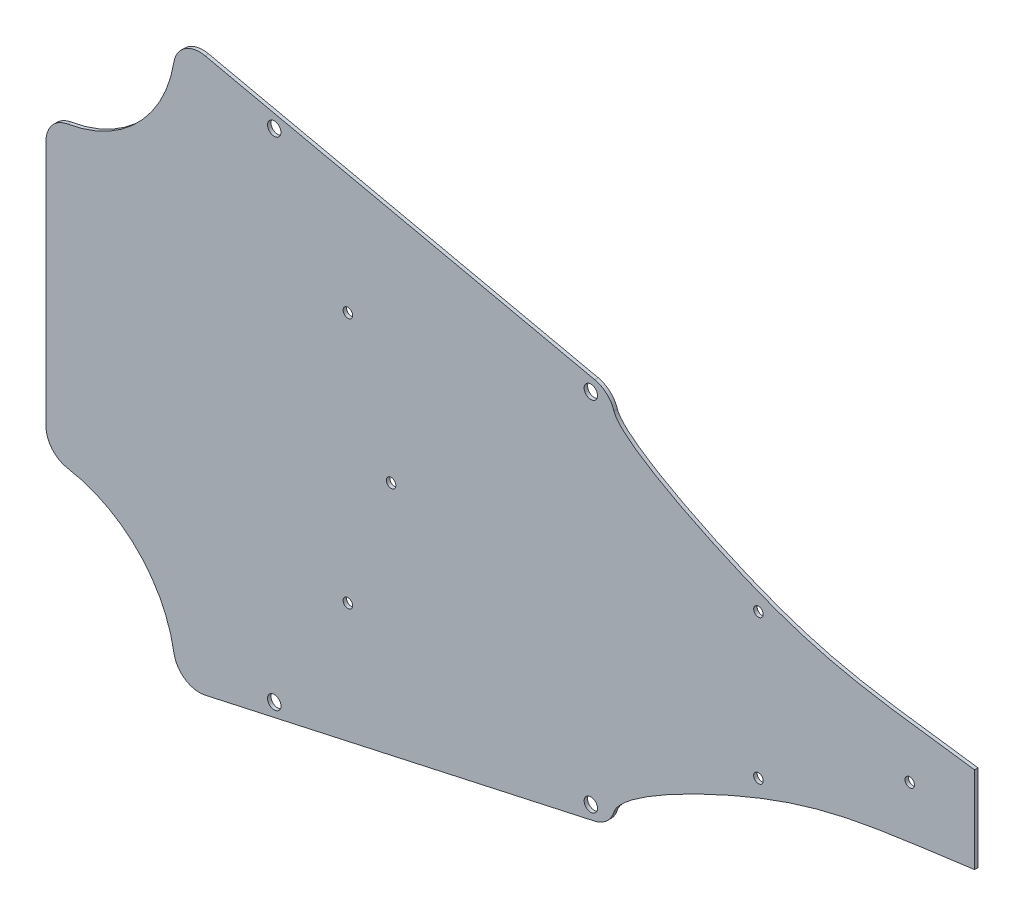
ISO-10303-21;
HEADER;
FILE_DESCRIPTION(('STEP AP214'),'2;1');
FILE_NAME('part.step','',(''),(''),'','','');
FILE_SCHEMA(('AUTOMOTIVE_DESIGN { 1 0 10303 214 1 1 1 1 }'));
ENDSEC;
DATA;
#1=APPLICATION_CONTEXT('core data for automotive mechanical design processes');
#2=APPLICATION_PROTOCOL_DEFINITION('international standard','automotive_design',2000,#1);
#3=PRODUCT_CONTEXT('',#1,'mechanical');
#4=PRODUCT('Part','Part','',(#3));
#5=PRODUCT_RELATED_PRODUCT_CATEGORY('part','',(#4));
#6=PRODUCT_DEFINITION_FORMATION('','',#4);
#7=PRODUCT_DEFINITION_CONTEXT('part definition',#1,'design');
#8=PRODUCT_DEFINITION('design','',#6,#7);
#9=PRODUCT_DEFINITION_SHAPE('','',#8);
#10=(LENGTH_UNIT() NAMED_UNIT(*) SI_UNIT(.MILLI.,.METRE.));
#11=(NAMED_UNIT(*) PLANE_ANGLE_UNIT() SI_UNIT($,.RADIAN.));
#12=(NAMED_UNIT(*) SI_UNIT($,.STERADIAN.) SOLID_ANGLE_UNIT());
#13=UNCERTAINTY_MEASURE_WITH_UNIT(LENGTH_MEASURE(1.E-05),#10,'distance_accuracy_value','');
#14=(GEOMETRIC_REPRESENTATION_CONTEXT(3) GLOBAL_UNCERTAINTY_ASSIGNED_CONTEXT((#13)) GLOBAL_UNIT_ASSIGNED_CONTEXT((#10,
#11,#12)) REPRESENTATION_CONTEXT('',''));
#15=CARTESIAN_POINT('',(0.,0.,0.));
#16=DIRECTION('',(0.,0.,1.));
#17=DIRECTION('',(1.,0.,0.));
#18=AXIS2_PLACEMENT_3D('',#15,#16,#17);
#19=CARTESIAN_POINT('',(60.6694487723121,58.200658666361,0.8));
#20=DIRECTION('',(0.,0.,1.));
#21=DIRECTION('',(1.,0.,0.));
#22=AXIS2_PLACEMENT_3D('',#19,#20,#21);
#23=PLANE('',#22);
#24=CARTESIAN_POINT('',(77.9645751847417,-57.4689156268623,0.8));
#25=DIRECTION('',(0.,0.,1.));
#26=DIRECTION('',(-1.,0.,0.));
#27=AXIS2_PLACEMENT_3D('',#24,#25,#26);
#28=CIRCLE('',#27,1.54999999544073);
#29=CARTESIAN_POINT('',(76.414575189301,-57.4689156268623,0.8));
#30=VERTEX_POINT('',#29);
#31=EDGE_CURVE('E460',#30,#30,#28,.T.);
#32=ORIENTED_EDGE('',*,*,#31,.F.);
#33=EDGE_LOOP('',(#32));
#34=FACE_BOUND('',#33,.T.);
#35=CARTESIAN_POINT('',(190.,-16.683070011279,0.8));
#36=DIRECTION('',(0.,0.,1.));
#37=DIRECTION('',(-1.,0.,0.));
#38=AXIS2_PLACEMENT_3D('',#35,#36,#37);
#39=CIRCLE('',#38,1.09999999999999);
#40=CARTESIAN_POINT('',(188.9,-16.683070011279,0.8));
#41=VERTEX_POINT('',#40);
#42=EDGE_CURVE('E472',#41,#41,#39,.T.);
#43=ORIENTED_EDGE('',*,*,#42,.F.);
#44=EDGE_LOOP('',(#43));
#45=FACE_BOUND('',#44,.T.);
#46=CARTESIAN_POINT('',(105.,0.,0.8));
#47=DIRECTION('',(0.,0.,1.));
#48=DIRECTION('',(1.,0.,0.));
#49=AXIS2_PLACEMENT_3D('',#46,#47,#48);
#50=CIRCLE('',#49,1.10000000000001);
#51=CARTESIAN_POINT('',(106.1,0.,0.8));
#52=VERTEX_POINT('',#51);
#53=EDGE_CURVE('E484',#52,#52,#50,.T.);
#54=ORIENTED_EDGE('',*,*,#53,.F.);
#55=EDGE_LOOP('',(#54));
#56=FACE_BOUND('',#55,.T.);
#57=CARTESIAN_POINT('',(190.,16.683070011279,0.8));
#58=DIRECTION('',(0.,0.,1.));
#59=DIRECTION('',(1.,0.,0.));
#60=AXIS2_PLACEMENT_3D('',#57,#58,#59);
#61=CIRCLE('',#60,1.09999999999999);
#62=CARTESIAN_POINT('',(191.1,16.683070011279,0.8));
#63=VERTEX_POINT('',#62);
#64=EDGE_CURVE('E496',#63,#63,#61,.T.);
#65=ORIENTED_EDGE('',*,*,#64,.F.);
#66=EDGE_LOOP('',(#65));
#67=FACE_BOUND('',#66,.T.);
#68=CARTESIAN_POINT('',(151.214241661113,41.3603352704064,0.8));
#69=DIRECTION('',(0.,0.,1.));
#70=DIRECTION('',(1.,0.,0.));
#71=AXIS2_PLACEMENT_3D('',#68,#69,#70);
#72=CIRCLE('',#71,1.54999999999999);
#73=CARTESIAN_POINT('',(152.764241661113,41.3603352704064,0.8));
#74=VERTEX_POINT('',#73);
#75=EDGE_CURVE('E146',#74,#74,#72,.T.);
#76=ORIENTED_EDGE('',*,*,#75,.F.);
#77=EDGE_LOOP('',(#76));
#78=FACE_BOUND('',#77,.T.);
#79=CARTESIAN_POINT('',(60.6694487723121,58.200658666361,0.8));
#80=DIRECTION('',(0.,0.,1.));
#81=DIRECTION('',(1.,0.,0.));
#82=AXIS2_PLACEMENT_3D('',#79,#80,#81);
#83=CIRCLE('',#82,6.);
#84=CARTESIAN_POINT('',(61.9581352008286,64.0606319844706,0.8));
#85=VERTEX_POINT('',#84);
#86=CARTESIAN_POINT('',(54.7496279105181,59.1782684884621,0.8));
#87=VERTEX_POINT('',#86);
#88=EDGE_CURVE('E186',#85,#87,#83,.T.);
#89=ORIENTED_EDGE('',*,*,#88,.T.);
#90=CARTESIAN_POINT('',(25.1505236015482,64.0663175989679,0.8));
#91=DIRECTION('',(0.,0.,-1.));
#92=DIRECTION('',(1.,0.,0.));
#93=AXIS2_PLACEMENT_3D('',#90,#91,#92);
#94=CIRCLE('',#93,30.);
#95=CARTESIAN_POINT('',(30.1505236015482,34.4859186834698,0.8));
#96=VERTEX_POINT('',#95);
#97=EDGE_CURVE('E141',#87,#96,#94,.T.);
#98=ORIENTED_EDGE('',*,*,#97,.T.);
#99=CARTESIAN_POINT('',(31.1505236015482,28.5698389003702,0.8));
#100=DIRECTION('',(0.,0.,1.));
#101=DIRECTION('',(1.,0.,0.));
#102=AXIS2_PLACEMENT_3D('',#99,#100,#101);
#103=CIRCLE('',#102,6.);
#104=CARTESIAN_POINT('',(25.1505236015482,28.5698389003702,0.8));
#105=VERTEX_POINT('',#104);
#106=EDGE_CURVE('E189',#96,#105,#103,.T.);
#107=ORIENTED_EDGE('',*,*,#106,.T.);
#108=DIRECTION('',(0.,-1.,0.));
#109=VECTOR('',#108,1.);
#110=CARTESIAN_POINT('',(25.1505236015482,28.5698389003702,0.8));
#111=LINE('',#110,#109);
#112=CARTESIAN_POINT('',(25.1505236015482,-28.5698389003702,0.8));
#113=VERTEX_POINT('',#112);
#114=EDGE_CURVE('E191',#105,#113,#111,.T.);
#115=ORIENTED_EDGE('',*,*,#114,.T.);
#116=CARTESIAN_POINT('',(31.1505236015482,-28.5698389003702,0.8));
#117=DIRECTION('',(0.,0.,1.));
#118=DIRECTION('',(-1.,0.,0.));
#119=AXIS2_PLACEMENT_3D('',#116,#117,#118);
#120=CIRCLE('',#119,6.);
#121=CARTESIAN_POINT('',(30.1505236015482,-34.4859186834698,0.8));
#122=VERTEX_POINT('',#121);
#123=EDGE_CURVE('E193',#113,#122,#120,.T.);
#124=ORIENTED_EDGE('',*,*,#123,.T.);
#125=CARTESIAN_POINT('',(25.1505236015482,-64.0663175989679,0.8));
#126=DIRECTION('',(0.,0.,-1.));
#127=DIRECTION('',(-1.,0.,0.));
#128=AXIS2_PLACEMENT_3D('',#125,#126,#127);
#129=CIRCLE('',#128,30.);
#130=CARTESIAN_POINT('',(54.7496279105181,-59.1782684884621,0.8));
#131=VERTEX_POINT('',#130);
#132=EDGE_CURVE('E195',#122,#131,#129,.T.);
#133=ORIENTED_EDGE('',*,*,#132,.T.);
#134=CARTESIAN_POINT('',(60.6694487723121,-58.200658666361,0.8));
#135=DIRECTION('',(0.,0.,1.));
#136=DIRECTION('',(-1.,0.,0.));
#137=AXIS2_PLACEMENT_3D('',#134,#135,#136);
#138=CIRCLE('',#137,6.);
#139=CARTESIAN_POINT('',(61.9581352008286,-64.0606319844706,0.8));
#140=VERTEX_POINT('',#139);
#141=EDGE_CURVE('E197',#131,#140,#138,.T.);
#142=ORIENTED_EDGE('',*,*,#141,.T.);
#143=DIRECTION('',(0.976662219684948,0.214781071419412,0.));
#144=VECTOR('',#143,1.);
#145=CARTESIAN_POINT('',(61.9581352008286,-64.0606319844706,0.8));
#146=LINE('',#145,#144);
#147=CARTESIAN_POINT('',(152.13131433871,-44.2303450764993,0.8));
#148=VERTEX_POINT('',#147);
#149=EDGE_CURVE('E199',#140,#148,#146,.T.);
#150=ORIENTED_EDGE('',*,*,#149,.T.);
#151=CARTESIAN_POINT('',(150.842627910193,-38.3703717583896,0.8));
#152=DIRECTION('',(0.,0.,1.));
#153=DIRECTION('',(1.,0.,0.));
#154=AXIS2_PLACEMENT_3D('',#151,#152,#153);
#155=CIRCLE('',#154,6.00000000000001);
#156=CARTESIAN_POINT('',(156.555979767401,-40.2027501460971,0.8));
#157=VERTEX_POINT('',#156);
#158=EDGE_CURVE('E201',#148,#157,#155,.T.);
#159=ORIENTED_EDGE('',*,*,#158,.T.);
#160=CARTESIAN_POINT('',(156.555979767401,-40.2027501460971,0.8));
#161=CARTESIAN_POINT('',(158.014867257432,-35.6539421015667,0.8));
#162=CARTESIAN_POINT('',(198.784165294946,-14.481909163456,0.8));
#163=CARTESIAN_POINT('',(216.274031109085,-13.2295178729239,0.8));
#164=CARTESIAN_POINT('',(240.,-10.,0.8));
#165=B_SPLINE_CURVE_WITH_KNOTS('',3,(#160,#161,#162,#163,#164),.UNSPECIFIED.,.F.,.F.,(4,1,4),
(0.,0.347185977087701,0.920874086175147),.UNSPECIFIED.);
#166=CARTESIAN_POINT('',(240.,-10.,0.8));
#167=VERTEX_POINT('',#166);
#168=EDGE_CURVE('E203',#157,#167,#165,.T.);
#169=ORIENTED_EDGE('',*,*,#168,.T.);
#170=DIRECTION('',(0.,1.,0.));
#171=VECTOR('',#170,1.);
#172=CARTESIAN_POINT('',(240.,10.,0.8));
#173=LINE('',#172,#171);
#174=CARTESIAN_POINT('',(240.,10.,0.8));
#175=VERTEX_POINT('',#174);
#176=EDGE_CURVE('E208',#167,#175,#173,.T.);
#177=ORIENTED_EDGE('',*,*,#176,.T.);
#178=CARTESIAN_POINT('',(240.,10.,0.8));
#179=CARTESIAN_POINT('',(216.274031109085,13.2295178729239,0.8));
#180=CARTESIAN_POINT('',(198.784165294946,14.481909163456,0.8));
#181=CARTESIAN_POINT('',(158.014867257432,35.6539421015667,0.8));
#182=CARTESIAN_POINT('',(156.555979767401,40.2027501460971,0.8));
#183=B_SPLINE_CURVE_WITH_KNOTS('',3,(#178,#179,#180,#181,#182),.UNSPECIFIED.,.F.,.F.,(4,1,4),
(0.,0.573688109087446,0.920874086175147),.UNSPECIFIED.);
#184=CARTESIAN_POINT('',(156.555979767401,40.2027501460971,0.8));
#185=VERTEX_POINT('',#184);
#186=EDGE_CURVE('E275',#175,#185,#183,.T.);
#187=ORIENTED_EDGE('',*,*,#186,.T.);
#188=CARTESIAN_POINT('',(150.842627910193,38.3703717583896,0.8));
#189=DIRECTION('',(0.,0.,1.));
#190=DIRECTION('',(-1.,0.,0.));
#191=AXIS2_PLACEMENT_3D('',#188,#189,#190);
#192=CIRCLE('',#191,6.00000000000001);
#193=CARTESIAN_POINT('',(152.13131433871,44.2303450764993,0.8));
#194=VERTEX_POINT('',#193);
#195=EDGE_CURVE('E46',#185,#194,#192,.T.);
#196=ORIENTED_EDGE('',*,*,#195,.T.);
#197=DIRECTION('',(-0.976662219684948,0.214781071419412,0.));
#198=VECTOR('',#197,1.);
#199=CARTESIAN_POINT('',(61.9581352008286,64.0606319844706,0.8));
#200=LINE('',#199,#198);
#201=EDGE_CURVE('E41',#194,#85,#200,.T.);
#202=ORIENTED_EDGE('',*,*,#201,.T.);
#203=EDGE_LOOP('',(#89,#98,#107,#115,#124,#133,#142,#150,#159,#169,#177,#187,#196,#202));
#204=FACE_BOUND('',#203,.T.);
#205=CARTESIAN_POINT('',(151.214241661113,-41.3603352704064,0.8));
#206=DIRECTION('',(0.,0.,1.));
#207=DIRECTION('',(-1.,0.,0.));
#208=AXIS2_PLACEMENT_3D('',#205,#206,#207);
#209=CIRCLE('',#208,1.54999999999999);
#210=CARTESIAN_POINT('',(149.664241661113,-41.3603352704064,0.8));
#211=VERTEX_POINT('',#210);
#212=EDGE_CURVE('E502',#211,#211,#209,.T.);
#213=ORIENTED_EDGE('',*,*,#212,.F.);
#214=EDGE_LOOP('',(#213));
#215=FACE_BOUND('',#214,.T.);
#216=CARTESIAN_POINT('',(225.,0.,0.8));
#217=DIRECTION('',(0.,0.,1.));
#218=DIRECTION('',(1.,0.,0.));
#219=AXIS2_PLACEMENT_3D('',#216,#217,#218);
#220=CIRCLE('',#219,1.09999999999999);
#221=CARTESIAN_POINT('',(226.1,0.,0.8));
#222=VERTEX_POINT('',#221);
#223=EDGE_CURVE('E490',#222,#222,#220,.T.);
#224=ORIENTED_EDGE('',*,*,#223,.F.);
#225=EDGE_LOOP('',(#224));
#226=FACE_BOUND('',#225,.T.);
#227=CARTESIAN_POINT('',(95.,29.078947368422,0.8));
#228=DIRECTION('',(0.,0.,1.));
#229=DIRECTION('',(1.,0.,0.));
#230=AXIS2_PLACEMENT_3D('',#227,#228,#229);
#231=CIRCLE('',#230,1.09999999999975);
#232=CARTESIAN_POINT('',(96.0999999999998,29.078947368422,0.8));
#233=VERTEX_POINT('',#232);
#234=EDGE_CURVE('E478',#233,#233,#231,.T.);
#235=ORIENTED_EDGE('',*,*,#234,.F.);
#236=EDGE_LOOP('',(#235));
#237=FACE_BOUND('',#236,.T.);
#238=CARTESIAN_POINT('',(95.,-29.0789473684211,0.8));
#239=DIRECTION('',(0.,0.,1.));
#240=DIRECTION('',(-1.,0.,0.));
#241=AXIS2_PLACEMENT_3D('',#238,#239,#240);
#242=CIRCLE('',#241,1.10000000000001);
#243=CARTESIAN_POINT('',(93.9,-29.0789473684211,0.8));
#244=VERTEX_POINT('',#243);
#245=EDGE_CURVE('E466',#244,#244,#242,.T.);
#246=ORIENTED_EDGE('',*,*,#245,.F.);
#247=EDGE_LOOP('',(#246));
#248=FACE_BOUND('',#247,.T.);
#249=CARTESIAN_POINT('',(77.9645751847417,57.4689156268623,0.8));
#250=DIRECTION('',(0.,0.,1.));
#251=DIRECTION('',(1.,0.,0.));
#252=AXIS2_PLACEMENT_3D('',#249,#250,#251);
#253=CIRCLE('',#252,1.54999999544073);
#254=CARTESIAN_POINT('',(79.5145751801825,57.4689156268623,0.8));
#255=VERTEX_POINT('',#254);
#256=EDGE_CURVE('E449',#255,#255,#253,.T.);
#257=ORIENTED_EDGE('',*,*,#256,.F.);
#258=EDGE_LOOP('',(#257));
#259=FACE_BOUND('',#258,.T.);
#260=ADVANCED_FACE('F26',(#34,#45,#56,#67,#78,#204,#215,#226,#237,#248,#259),#23,.T.);
#261=CARTESIAN_POINT('',(60.6694487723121,58.200658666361,0.));
#262=DIRECTION('',(0.,0.,1.));
#263=DIRECTION('',(1.,0.,0.));
#264=AXIS2_PLACEMENT_3D('',#261,#262,#263);
#265=PLANE('',#264);
#266=CARTESIAN_POINT('',(77.9645751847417,-57.4689156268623,0.));
#267=DIRECTION('',(0.,0.,1.));
#268=DIRECTION('',(-1.,0.,0.));
#269=AXIS2_PLACEMENT_3D('',#266,#267,#268);
#270=CIRCLE('',#269,1.54999999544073);
#271=CARTESIAN_POINT('',(76.414575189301,-57.4689156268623,0.));
#272=VERTEX_POINT('',#271);
#273=EDGE_CURVE('E455',#272,#272,#270,.T.);
#274=ORIENTED_EDGE('',*,*,#273,.T.);
#275=EDGE_LOOP('',(#274));
#276=FACE_BOUND('',#275,.T.);
#277=CARTESIAN_POINT('',(190.,-16.683070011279,0.));
#278=DIRECTION('',(0.,0.,1.));
#279=DIRECTION('',(-1.,0.,0.));
#280=AXIS2_PLACEMENT_3D('',#277,#278,#279);
#281=CIRCLE('',#280,1.09999999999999);
#282=CARTESIAN_POINT('',(188.9,-16.683070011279,0.));
#283=VERTEX_POINT('',#282);
#284=EDGE_CURVE('E469',#283,#283,#281,.T.);
#285=ORIENTED_EDGE('',*,*,#284,.T.);
#286=EDGE_LOOP('',(#285));
#287=FACE_BOUND('',#286,.T.);
#288=CARTESIAN_POINT('',(105.,0.,0.));
#289=DIRECTION('',(0.,0.,1.));
#290=DIRECTION('',(1.,0.,0.));
#291=AXIS2_PLACEMENT_3D('',#288,#289,#290);
#292=CIRCLE('',#291,1.10000000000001);
#293=CARTESIAN_POINT('',(106.1,0.,0.));
#294=VERTEX_POINT('',#293);
#295=EDGE_CURVE('E481',#294,#294,#292,.T.);
#296=ORIENTED_EDGE('',*,*,#295,.T.);
#297=EDGE_LOOP('',(#296));
#298=FACE_BOUND('',#297,.T.);
#299=CARTESIAN_POINT('',(190.,16.683070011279,0.));
#300=DIRECTION('',(0.,0.,1.));
#301=DIRECTION('',(1.,0.,0.));
#302=AXIS2_PLACEMENT_3D('',#299,#300,#301);
#303=CIRCLE('',#302,1.09999999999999);
#304=CARTESIAN_POINT('',(191.1,16.683070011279,0.));
#305=VERTEX_POINT('',#304);
#306=EDGE_CURVE('E493',#305,#305,#303,.T.);
#307=ORIENTED_EDGE('',*,*,#306,.T.);
#308=EDGE_LOOP('',(#307));
#309=FACE_BOUND('',#308,.T.);
#310=CARTESIAN_POINT('',(151.214241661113,41.3603352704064,0.));
#311=DIRECTION('',(0.,0.,1.));
#312=DIRECTION('',(1.,0.,0.));
#313=AXIS2_PLACEMENT_3D('',#310,#311,#312);
#314=CIRCLE('',#313,1.54999999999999);
#315=CARTESIAN_POINT('',(152.764241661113,41.3603352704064,0.));
#316=VERTEX_POINT('',#315);
#317=EDGE_CURVE('E149',#316,#316,#314,.T.);
#318=ORIENTED_EDGE('',*,*,#317,.T.);
#319=EDGE_LOOP('',(#318));
#320=FACE_BOUND('',#319,.T.);
#321=CARTESIAN_POINT('',(60.6694487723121,58.200658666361,0.));
#322=DIRECTION('',(0.,0.,1.));
#323=DIRECTION('',(1.,0.,0.));
#324=AXIS2_PLACEMENT_3D('',#321,#322,#323);
#325=CIRCLE('',#324,6.);
#326=CARTESIAN_POINT('',(61.9581352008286,64.0606319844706,0.));
#327=VERTEX_POINT('',#326);
#328=CARTESIAN_POINT('',(54.7496279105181,59.1782684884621,0.));
#329=VERTEX_POINT('',#328);
#330=EDGE_CURVE('E132',#327,#329,#325,.T.);
#331=ORIENTED_EDGE('',*,*,#330,.F.);
#332=DIRECTION('',(-0.976662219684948,0.214781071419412,0.));
#333=VECTOR('',#332,1.);
#334=CARTESIAN_POINT('',(61.9581352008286,64.0606319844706,0.));
#335=LINE('',#334,#333);
#336=CARTESIAN_POINT('',(152.13131433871,44.2303450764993,0.));
#337=VERTEX_POINT('',#336);
#338=EDGE_CURVE('E184',#337,#327,#335,.T.);
#339=ORIENTED_EDGE('',*,*,#338,.F.);
#340=CARTESIAN_POINT('',(150.842627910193,38.3703717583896,0.));
#341=DIRECTION('',(0.,0.,1.));
#342=DIRECTION('',(-1.,0.,0.));
#343=AXIS2_PLACEMENT_3D('',#340,#341,#342);
#344=CIRCLE('',#343,6.00000000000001);
#345=CARTESIAN_POINT('',(156.555979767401,40.2027501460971,0.));
#346=VERTEX_POINT('',#345);
#347=EDGE_CURVE('E179',#346,#337,#344,.T.);
#348=ORIENTED_EDGE('',*,*,#347,.F.);
#349=CARTESIAN_POINT('',(240.,10.,0.));
#350=CARTESIAN_POINT('',(216.274031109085,13.2295178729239,0.));
#351=CARTESIAN_POINT('',(198.784165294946,14.481909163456,0.));
#352=CARTESIAN_POINT('',(158.014867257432,35.6539421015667,0.));
#353=CARTESIAN_POINT('',(156.555979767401,40.2027501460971,0.));
#354=B_SPLINE_CURVE_WITH_KNOTS('',3,(#349,#350,#351,#352,#353),.UNSPECIFIED.,.F.,.F.,(4,1,4),
(0.,0.573688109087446,0.920874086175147),.UNSPECIFIED.);
#355=CARTESIAN_POINT('',(240.,10.,0.));
#356=VERTEX_POINT('',#355);
#357=EDGE_CURVE('E175',#356,#346,#354,.T.);
#358=ORIENTED_EDGE('',*,*,#357,.F.);
#359=DIRECTION('',(0.,1.,0.));
#360=VECTOR('',#359,1.);
#361=CARTESIAN_POINT('',(240.,10.,0.));
#362=LINE('',#361,#360);
#363=CARTESIAN_POINT('',(240.,-10.,0.));
#364=VERTEX_POINT('',#363);
#365=EDGE_CURVE('E170',#364,#356,#362,.T.);
#366=ORIENTED_EDGE('',*,*,#365,.F.);
#367=CARTESIAN_POINT('',(156.555979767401,-40.2027501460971,0.));
#368=CARTESIAN_POINT('',(158.014867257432,-35.6539421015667,0.));
#369=CARTESIAN_POINT('',(198.784165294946,-14.481909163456,0.));
#370=CARTESIAN_POINT('',(216.274031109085,-13.2295178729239,0.));
#371=CARTESIAN_POINT('',(240.,-10.,0.));
#372=B_SPLINE_CURVE_WITH_KNOTS('',3,(#367,#368,#369,#370,#371),.UNSPECIFIED.,.F.,.F.,(4,1,4),
(0.,0.347185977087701,0.920874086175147),.UNSPECIFIED.);
#373=CARTESIAN_POINT('',(156.555979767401,-40.2027501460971,0.));
#374=VERTEX_POINT('',#373);
#375=EDGE_CURVE('E166',#374,#364,#372,.T.);
#376=ORIENTED_EDGE('',*,*,#375,.F.);
#377=CARTESIAN_POINT('',(150.842627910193,-38.3703717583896,0.));
#378=DIRECTION('',(0.,0.,1.));
#379=DIRECTION('',(1.,0.,0.));
#380=AXIS2_PLACEMENT_3D('',#377,#378,#379);
#381=CIRCLE('',#380,6.00000000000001);
#382=CARTESIAN_POINT('',(152.13131433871,-44.2303450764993,0.));
#383=VERTEX_POINT('',#382);
#384=EDGE_CURVE('E164',#383,#374,#381,.T.);
#385=ORIENTED_EDGE('',*,*,#384,.F.);
#386=DIRECTION('',(0.976662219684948,0.214781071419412,0.));
#387=VECTOR('',#386,1.);
#388=CARTESIAN_POINT('',(61.9581352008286,-64.0606319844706,0.));
#389=LINE('',#388,#387);
#390=CARTESIAN_POINT('',(61.9581352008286,-64.0606319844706,0.));
#391=VERTEX_POINT('',#390);
#392=EDGE_CURVE('E162',#391,#383,#389,.T.);
#393=ORIENTED_EDGE('',*,*,#392,.F.);
#394=CARTESIAN_POINT('',(60.6694487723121,-58.200658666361,0.));
#395=DIRECTION('',(0.,0.,1.));
#396=DIRECTION('',(-1.,0.,0.));
#397=AXIS2_PLACEMENT_3D('',#394,#395,#396);
#398=CIRCLE('',#397,6.);
#399=CARTESIAN_POINT('',(54.7496279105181,-59.1782684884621,0.));
#400=VERTEX_POINT('',#399);
#401=EDGE_CURVE('E160',#400,#391,#398,.T.);
#402=ORIENTED_EDGE('',*,*,#401,.F.);
#403=CARTESIAN_POINT('',(25.1505236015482,-64.0663175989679,0.));
#404=DIRECTION('',(0.,0.,-1.));
#405=DIRECTION('',(-1.,0.,0.));
#406=AXIS2_PLACEMENT_3D('',#403,#404,#405);
#407=CIRCLE('',#406,30.);
#408=CARTESIAN_POINT('',(30.1505236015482,-34.4859186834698,0.));
#409=VERTEX_POINT('',#408);
#410=EDGE_CURVE('E158',#409,#400,#407,.T.);
#411=ORIENTED_EDGE('',*,*,#410,.F.);
#412=CARTESIAN_POINT('',(31.1505236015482,-28.5698389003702,0.));
#413=DIRECTION('',(0.,0.,1.));
#414=DIRECTION('',(-1.,0.,0.));
#415=AXIS2_PLACEMENT_3D('',#412,#413,#414);
#416=CIRCLE('',#415,6.);
#417=CARTESIAN_POINT('',(25.1505236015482,-28.5698389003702,0.));
#418=VERTEX_POINT('',#417);
#419=EDGE_CURVE('E156',#418,#409,#416,.T.);
#420=ORIENTED_EDGE('',*,*,#419,.F.);
#421=DIRECTION('',(0.,-1.,0.));
#422=VECTOR('',#421,1.);
#423=CARTESIAN_POINT('',(25.1505236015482,28.5698389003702,0.));
#424=LINE('',#423,#422);
#425=CARTESIAN_POINT('',(25.1505236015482,28.5698389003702,0.));
#426=VERTEX_POINT('',#425);
#427=EDGE_CURVE('E154',#426,#418,#424,.T.);
#428=ORIENTED_EDGE('',*,*,#427,.F.);
#429=CARTESIAN_POINT('',(31.1505236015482,28.5698389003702,0.));
#430=DIRECTION('',(0.,0.,1.));
#431=DIRECTION('',(1.,0.,0.));
#432=AXIS2_PLACEMENT_3D('',#429,#430,#431);
#433=CIRCLE('',#432,6.);
#434=CARTESIAN_POINT('',(30.1505236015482,34.4859186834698,0.));
#435=VERTEX_POINT('',#434);
#436=EDGE_CURVE('E134',#435,#426,#433,.T.);
#437=ORIENTED_EDGE('',*,*,#436,.F.);
#438=CARTESIAN_POINT('',(25.1505236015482,64.0663175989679,0.));
#439=DIRECTION('',(0.,0.,-1.));
#440=DIRECTION('',(1.,0.,0.));
#441=AXIS2_PLACEMENT_3D('',#438,#439,#440);
#442=CIRCLE('',#441,30.);
#443=EDGE_CURVE('E127',#329,#435,#442,.T.);
#444=ORIENTED_EDGE('',*,*,#443,.F.);
#445=EDGE_LOOP('',(#331,#339,#348,#358,#366,#376,#385,#393,#402,#411,#420,#428,#437,#444));
#446=FACE_BOUND('',#445,.T.);
#447=CARTESIAN_POINT('',(151.214241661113,-41.3603352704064,0.));
#448=DIRECTION('',(0.,0.,1.));
#449=DIRECTION('',(-1.,0.,0.));
#450=AXIS2_PLACEMENT_3D('',#447,#448,#449);
#451=CIRCLE('',#450,1.54999999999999);
#452=CARTESIAN_POINT('',(149.664241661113,-41.3603352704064,0.));
#453=VERTEX_POINT('',#452);
#454=EDGE_CURVE('E499',#453,#453,#451,.T.);
#455=ORIENTED_EDGE('',*,*,#454,.T.);
#456=EDGE_LOOP('',(#455));
#457=FACE_BOUND('',#456,.T.);
#458=CARTESIAN_POINT('',(225.,0.,0.));
#459=DIRECTION('',(0.,0.,1.));
#460=DIRECTION('',(1.,0.,0.));
#461=AXIS2_PLACEMENT_3D('',#458,#459,#460);
#462=CIRCLE('',#461,1.09999999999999);
#463=CARTESIAN_POINT('',(226.1,0.,0.));
#464=VERTEX_POINT('',#463);
#465=EDGE_CURVE('E487',#464,#464,#462,.T.);
#466=ORIENTED_EDGE('',*,*,#465,.T.);
#467=EDGE_LOOP('',(#466));
#468=FACE_BOUND('',#467,.T.);
#469=CARTESIAN_POINT('',(95.,29.078947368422,0.));
#470=DIRECTION('',(0.,0.,1.));
#471=DIRECTION('',(1.,0.,0.));
#472=AXIS2_PLACEMENT_3D('',#469,#470,#471);
#473=CIRCLE('',#472,1.09999999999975);
#474=CARTESIAN_POINT('',(96.0999999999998,29.078947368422,0.));
#475=VERTEX_POINT('',#474);
#476=EDGE_CURVE('E475',#475,#475,#473,.T.);
#477=ORIENTED_EDGE('',*,*,#476,.T.);
#478=EDGE_LOOP('',(#477));
#479=FACE_BOUND('',#478,.T.);
#480=CARTESIAN_POINT('',(95.,-29.0789473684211,0.));
#481=DIRECTION('',(0.,0.,1.));
#482=DIRECTION('',(-1.,0.,0.));
#483=AXIS2_PLACEMENT_3D('',#480,#481,#482);
#484=CIRCLE('',#483,1.10000000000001);
#485=CARTESIAN_POINT('',(93.9,-29.0789473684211,0.));
#486=VERTEX_POINT('',#485);
#487=EDGE_CURVE('E463',#486,#486,#484,.T.);
#488=ORIENTED_EDGE('',*,*,#487,.T.);
#489=EDGE_LOOP('',(#488));
#490=FACE_BOUND('',#489,.T.);
#491=CARTESIAN_POINT('',(77.9645751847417,57.4689156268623,0.));
#492=DIRECTION('',(0.,0.,1.));
#493=DIRECTION('',(1.,0.,0.));
#494=AXIS2_PLACEMENT_3D('',#491,#492,#493);
#495=CIRCLE('',#494,1.54999999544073);
#496=CARTESIAN_POINT('',(79.5145751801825,57.4689156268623,0.));
#497=VERTEX_POINT('',#496);
#498=EDGE_CURVE('E452',#497,#497,#495,.T.);
#499=ORIENTED_EDGE('',*,*,#498,.T.);
#500=EDGE_LOOP('',(#499));
#501=FACE_BOUND('',#500,.T.);
#502=ADVANCED_FACE('F128',(#276,#287,#298,#309,#320,#446,#457,#468,#479,#490,#501),#265,.F.);
#503=CARTESIAN_POINT('',(60.6694487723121,58.200658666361,0.8));
#504=DIRECTION('',(0.,0.,-1.));
#505=DIRECTION('',(-1.,0.,0.));
#506=AXIS2_PLACEMENT_3D('',#503,#504,#505);
#507=CYLINDRICAL_SURFACE('',#506,6.);
#508=ORIENTED_EDGE('',*,*,#330,.T.);
#509=DIRECTION('',(0.,0.,-1.));
#510=VECTOR('',#509,1.);
#511=CARTESIAN_POINT('',(54.7496279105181,59.1782684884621,0.8));
#512=LINE('',#511,#510);
#513=EDGE_CURVE('E11',#87,#329,#512,.T.);
#514=ORIENTED_EDGE('',*,*,#513,.F.);
#515=ORIENTED_EDGE('',*,*,#88,.F.);
#516=DIRECTION('',(0.,0.,-1.));
#517=VECTOR('',#516,1.);
#518=CARTESIAN_POINT('',(61.9581352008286,64.0606319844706,0.8));
#519=LINE('',#518,#517);
#520=EDGE_CURVE('E145',#85,#327,#519,.T.);
#521=ORIENTED_EDGE('',*,*,#520,.T.);
#522=EDGE_LOOP('',(#508,#514,#515,#521));
#523=FACE_BOUND('',#522,.T.);
#524=ADVANCED_FACE('F28',(#523),#507,.T.);
#525=CARTESIAN_POINT('',(25.1505236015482,64.0663175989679,0.8));
#526=DIRECTION('',(0.,0.,-1.));
#527=DIRECTION('',(-1.,0.,0.));
#528=AXIS2_PLACEMENT_3D('',#525,#526,#527);
#529=CYLINDRICAL_SURFACE('',#528,30.);
#530=ORIENTED_EDGE('',*,*,#443,.T.);
#531=DIRECTION('',(0.,0.,-1.));
#532=VECTOR('',#531,1.);
#533=CARTESIAN_POINT('',(30.1505236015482,34.4859186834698,0.8));
#534=LINE('',#533,#532);
#535=EDGE_CURVE('E34',#96,#435,#534,.T.);
#536=ORIENTED_EDGE('',*,*,#535,.F.);
#537=ORIENTED_EDGE('',*,*,#97,.F.);
#538=ORIENTED_EDGE('',*,*,#513,.T.);
#539=EDGE_LOOP('',(#530,#536,#537,#538));
#540=FACE_BOUND('',#539,.T.);
#541=ADVANCED_FACE('F140',(#540),#529,.F.);
#542=CARTESIAN_POINT('',(31.1505236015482,28.5698389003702,0.8));
#543=DIRECTION('',(0.,0.,-1.));
#544=DIRECTION('',(-1.,0.,0.));
#545=AXIS2_PLACEMENT_3D('',#542,#543,#544);
#546=CYLINDRICAL_SURFACE('',#545,6.);
#547=ORIENTED_EDGE('',*,*,#436,.T.);
#548=DIRECTION('',(0.,0.,-1.));
#549=VECTOR('',#548,1.);
#550=CARTESIAN_POINT('',(25.1505236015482,28.5698389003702,0.8));
#551=LINE('',#550,#549);
#552=EDGE_CURVE('E316',#105,#426,#551,.T.);
#553=ORIENTED_EDGE('',*,*,#552,.F.);
#554=ORIENTED_EDGE('',*,*,#106,.F.);
#555=ORIENTED_EDGE('',*,*,#535,.T.);
#556=EDGE_LOOP('',(#547,#553,#554,#555));
#557=FACE_BOUND('',#556,.T.);
#558=ADVANCED_FACE('F244',(#557),#546,.T.);
#559=CARTESIAN_POINT('',(25.1505236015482,28.5698389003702,0.8));
#560=DIRECTION('',(1.,0.,0.));
#561=DIRECTION('',(0.,0.,-1.));
#562=AXIS2_PLACEMENT_3D('',#559,#560,#561);
#563=PLANE('',#562);
#564=ORIENTED_EDGE('',*,*,#427,.T.);
#565=DIRECTION('',(0.,0.,-1.));
#566=VECTOR('',#565,1.);
#567=CARTESIAN_POINT('',(25.1505236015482,-28.5698389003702,0.8));
#568=LINE('',#567,#566);
#569=EDGE_CURVE('E313',#113,#418,#568,.T.);
#570=ORIENTED_EDGE('',*,*,#569,.F.);
#571=ORIENTED_EDGE('',*,*,#114,.F.);
#572=ORIENTED_EDGE('',*,*,#552,.T.);
#573=EDGE_LOOP('',(#564,#570,#571,#572));
#574=FACE_BOUND('',#573,.T.);
#575=ADVANCED_FACE('F240',(#574),#563,.F.);
#576=CARTESIAN_POINT('',(31.1505236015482,-28.5698389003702,0.8));
#577=DIRECTION('',(0.,0.,-1.));
#578=DIRECTION('',(-1.,0.,0.));
#579=AXIS2_PLACEMENT_3D('',#576,#577,#578);
#580=CYLINDRICAL_SURFACE('',#579,6.);
#581=ORIENTED_EDGE('',*,*,#419,.T.);
#582=DIRECTION('',(0.,0.,-1.));
#583=VECTOR('',#582,1.);
#584=CARTESIAN_POINT('',(30.1505236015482,-34.4859186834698,0.8));
#585=LINE('',#584,#583);
#586=EDGE_CURVE('E310',#122,#409,#585,.T.);
#587=ORIENTED_EDGE('',*,*,#586,.F.);
#588=ORIENTED_EDGE('',*,*,#123,.F.);
#589=ORIENTED_EDGE('',*,*,#569,.T.);
#590=EDGE_LOOP('',(#581,#587,#588,#589));
#591=FACE_BOUND('',#590,.T.);
#592=ADVANCED_FACE('F236',(#591),#580,.T.);
#593=CARTESIAN_POINT('',(25.1505236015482,-64.0663175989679,0.8));
#594=DIRECTION('',(0.,0.,-1.));
#595=DIRECTION('',(-1.,0.,0.));
#596=AXIS2_PLACEMENT_3D('',#593,#594,#595);
#597=CYLINDRICAL_SURFACE('',#596,30.);
#598=ORIENTED_EDGE('',*,*,#410,.T.);
#599=DIRECTION('',(0.,0.,-1.));
#600=VECTOR('',#599,1.);
#601=CARTESIAN_POINT('',(54.7496279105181,-59.1782684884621,0.8));
#602=LINE('',#601,#600);
#603=EDGE_CURVE('E307',#131,#400,#602,.T.);
#604=ORIENTED_EDGE('',*,*,#603,.F.);
#605=ORIENTED_EDGE('',*,*,#132,.F.);
#606=ORIENTED_EDGE('',*,*,#586,.T.);
#607=EDGE_LOOP('',(#598,#604,#605,#606));
#608=FACE_BOUND('',#607,.T.);
#609=ADVANCED_FACE('F232',(#608),#597,.F.);
#610=CARTESIAN_POINT('',(60.6694487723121,-58.200658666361,0.8));
#611=DIRECTION('',(0.,0.,-1.));
#612=DIRECTION('',(-1.,0.,0.));
#613=AXIS2_PLACEMENT_3D('',#610,#611,#612);
#614=CYLINDRICAL_SURFACE('',#613,6.);
#615=ORIENTED_EDGE('',*,*,#401,.T.);
#616=DIRECTION('',(0.,0.,-1.));
#617=VECTOR('',#616,1.);
#618=CARTESIAN_POINT('',(61.9581352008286,-64.0606319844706,0.8));
#619=LINE('',#618,#617);
#620=EDGE_CURVE('E304',#140,#391,#619,.T.);
#621=ORIENTED_EDGE('',*,*,#620,.F.);
#622=ORIENTED_EDGE('',*,*,#141,.F.);
#623=ORIENTED_EDGE('',*,*,#603,.T.);
#624=EDGE_LOOP('',(#615,#621,#622,#623));
#625=FACE_BOUND('',#624,.T.);
#626=ADVANCED_FACE('F228',(#625),#614,.T.);
#627=CARTESIAN_POINT('',(61.9581352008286,-64.0606319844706,0.8));
#628=DIRECTION('',(-0.214781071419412,0.976662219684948,0.));
#629=DIRECTION('',(-0.976662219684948,-0.214781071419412,0.));
#630=AXIS2_PLACEMENT_3D('',#627,#628,#629);
#631=PLANE('',#630);
#632=ORIENTED_EDGE('',*,*,#392,.T.);
#633=DIRECTION('',(0.,0.,-1.));
#634=VECTOR('',#633,1.);
#635=CARTESIAN_POINT('',(152.13131433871,-44.2303450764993,0.8));
#636=LINE('',#635,#634);
#637=EDGE_CURVE('E301',#148,#383,#636,.T.);
#638=ORIENTED_EDGE('',*,*,#637,.F.);
#639=ORIENTED_EDGE('',*,*,#149,.F.);
#640=ORIENTED_EDGE('',*,*,#620,.T.);
#641=EDGE_LOOP('',(#632,#638,#639,#640));
#642=FACE_BOUND('',#641,.T.);
#643=ADVANCED_FACE('F224',(#642),#631,.F.);
#644=CARTESIAN_POINT('',(150.842627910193,-38.3703717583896,0.8));
#645=DIRECTION('',(0.,0.,-1.));
#646=DIRECTION('',(-1.,0.,0.));
#647=AXIS2_PLACEMENT_3D('',#644,#645,#646);
#648=CYLINDRICAL_SURFACE('',#647,6.00000000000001);
#649=ORIENTED_EDGE('',*,*,#384,.T.);
#650=DIRECTION('',(0.,0.,-1.));
#651=VECTOR('',#650,1.);
#652=CARTESIAN_POINT('',(156.555979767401,-40.2027501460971,0.8));
#653=LINE('',#652,#651);
#654=EDGE_CURVE('E298',#157,#374,#653,.T.);
#655=ORIENTED_EDGE('',*,*,#654,.F.);
#656=ORIENTED_EDGE('',*,*,#158,.F.);
#657=ORIENTED_EDGE('',*,*,#637,.T.);
#658=EDGE_LOOP('',(#649,#655,#656,#657));
#659=FACE_BOUND('',#658,.T.);
#660=ADVANCED_FACE('F219',(#659),#648,.T.);
#661=DIRECTION('',(0.,0.,-1.));
#662=VECTOR('',#661,1.);
#663=SURFACE_OF_LINEAR_EXTRUSION('',#165,#662);
#664=ORIENTED_EDGE('',*,*,#375,.T.);
#665=DIRECTION('',(0.,0.,-1.));
#666=VECTOR('',#665,1.);
#667=CARTESIAN_POINT('',(240.,-10.,0.8));
#668=LINE('',#667,#666);
#669=EDGE_CURVE('E295',#167,#364,#668,.T.);
#670=ORIENTED_EDGE('',*,*,#669,.F.);
#671=ORIENTED_EDGE('',*,*,#168,.F.);
#672=ORIENTED_EDGE('',*,*,#654,.T.);
#673=EDGE_LOOP('',(#664,#670,#671,#672));
#674=FACE_BOUND('',#673,.T.);
#675=ADVANCED_FACE('F214',(#674),#663,.F.);
#676=CARTESIAN_POINT('',(240.,10.,0.8));
#677=DIRECTION('',(-1.,0.,0.));
#678=DIRECTION('',(0.,0.,1.));
#679=AXIS2_PLACEMENT_3D('',#676,#677,#678);
#680=PLANE('',#679);
#681=ORIENTED_EDGE('',*,*,#365,.T.);
#682=DIRECTION('',(0.,0.,-1.));
#683=VECTOR('',#682,1.);
#684=CARTESIAN_POINT('',(240.,10.,0.8));
#685=LINE('',#684,#683);
#686=EDGE_CURVE('E292',#175,#356,#685,.T.);
#687=ORIENTED_EDGE('',*,*,#686,.F.);
#688=ORIENTED_EDGE('',*,*,#176,.F.);
#689=ORIENTED_EDGE('',*,*,#669,.T.);
#690=EDGE_LOOP('',(#681,#687,#688,#689));
#691=FACE_BOUND('',#690,.T.);
#692=ADVANCED_FACE('F218',(#691),#680,.F.);
#693=DIRECTION('',(0.,0.,-1.));
#694=VECTOR('',#693,1.);
#695=SURFACE_OF_LINEAR_EXTRUSION('',#183,#694);
#696=ORIENTED_EDGE('',*,*,#357,.T.);
#697=DIRECTION('',(0.,0.,-1.));
#698=VECTOR('',#697,1.);
#699=CARTESIAN_POINT('',(156.555979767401,40.2027501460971,0.8));
#700=LINE('',#699,#698);
#701=EDGE_CURVE('E289',#185,#346,#700,.T.);
#702=ORIENTED_EDGE('',*,*,#701,.F.);
#703=ORIENTED_EDGE('',*,*,#186,.F.);
#704=ORIENTED_EDGE('',*,*,#686,.T.);
#705=EDGE_LOOP('',(#696,#702,#703,#704));
#706=FACE_BOUND('',#705,.T.);
#707=ADVANCED_FACE('F271',(#706),#695,.F.);
#708=CARTESIAN_POINT('',(150.842627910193,38.3703717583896,0.8));
#709=DIRECTION('',(0.,0.,-1.));
#710=DIRECTION('',(-1.,0.,0.));
#711=AXIS2_PLACEMENT_3D('',#708,#709,#710);
#712=CYLINDRICAL_SURFACE('',#711,6.00000000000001);
#713=ORIENTED_EDGE('',*,*,#347,.T.);
#714=DIRECTION('',(0.,0.,-1.));
#715=VECTOR('',#714,1.);
#716=CARTESIAN_POINT('',(152.13131433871,44.2303450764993,0.8));
#717=LINE('',#716,#715);
#718=EDGE_CURVE('E286',#194,#337,#717,.T.);
#719=ORIENTED_EDGE('',*,*,#718,.F.);
#720=ORIENTED_EDGE('',*,*,#195,.F.);
#721=ORIENTED_EDGE('',*,*,#701,.T.);
#722=EDGE_LOOP('',(#713,#719,#720,#721));
#723=FACE_BOUND('',#722,.T.);
#724=ADVANCED_FACE('F268',(#723),#712,.T.);
#725=CARTESIAN_POINT('',(61.9581352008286,64.0606319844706,0.8));
#726=DIRECTION('',(-0.214781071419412,-0.976662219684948,0.));
#727=DIRECTION('',(0.976662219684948,-0.214781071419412,0.));
#728=AXIS2_PLACEMENT_3D('',#725,#726,#727);
#729=PLANE('',#728);
#730=ORIENTED_EDGE('',*,*,#338,.T.);
#731=ORIENTED_EDGE('',*,*,#520,.F.);
#732=ORIENTED_EDGE('',*,*,#201,.F.);
#733=ORIENTED_EDGE('',*,*,#718,.T.);
#734=EDGE_LOOP('',(#730,#731,#732,#733));
#735=FACE_BOUND('',#734,.T.);
#736=ADVANCED_FACE('F264',(#735),#729,.F.);
#737=CARTESIAN_POINT('',(151.214241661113,41.3603352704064,0.8));
#738=DIRECTION('',(0.,0.,-1.));
#739=DIRECTION('',(-1.,0.,0.));
#740=AXIS2_PLACEMENT_3D('',#737,#738,#739);
#741=CYLINDRICAL_SURFACE('',#740,1.54999999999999);
#742=ORIENTED_EDGE('',*,*,#75,.T.);
#743=EDGE_LOOP('',(#742));
#744=FACE_BOUND('',#743,.T.);
#745=ORIENTED_EDGE('',*,*,#317,.F.);
#746=EDGE_LOOP('',(#745));
#747=FACE_BOUND('',#746,.T.);
#748=ADVANCED_FACE('F267',(#744,#747),#741,.F.);
#749=CARTESIAN_POINT('',(151.214241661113,-41.3603352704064,0.8));
#750=DIRECTION('',(0.,0.,-1.));
#751=DIRECTION('',(-1.,0.,0.));
#752=AXIS2_PLACEMENT_3D('',#749,#750,#751);
#753=CYLINDRICAL_SURFACE('',#752,1.54999999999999);
#754=ORIENTED_EDGE('',*,*,#212,.T.);
#755=EDGE_LOOP('',(#754));
#756=FACE_BOUND('',#755,.T.);
#757=ORIENTED_EDGE('',*,*,#454,.F.);
#758=EDGE_LOOP('',(#757));
#759=FACE_BOUND('',#758,.T.);
#760=ADVANCED_FACE('F372',(#756,#759),#753,.F.);
#761=CARTESIAN_POINT('',(190.,16.683070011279,0.8));
#762=DIRECTION('',(0.,0.,-1.));
#763=DIRECTION('',(-1.,0.,0.));
#764=AXIS2_PLACEMENT_3D('',#761,#762,#763);
#765=CYLINDRICAL_SURFACE('',#764,1.09999999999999);
#766=ORIENTED_EDGE('',*,*,#64,.T.);
#767=EDGE_LOOP('',(#766));
#768=FACE_BOUND('',#767,.T.);
#769=ORIENTED_EDGE('',*,*,#306,.F.);
#770=EDGE_LOOP('',(#769));
#771=FACE_BOUND('',#770,.T.);
#772=ADVANCED_FACE('F379',(#768,#771),#765,.F.);
#773=CARTESIAN_POINT('',(225.,0.,0.8));
#774=DIRECTION('',(0.,0.,-1.));
#775=DIRECTION('',(-1.,0.,0.));
#776=AXIS2_PLACEMENT_3D('',#773,#774,#775);
#777=CYLINDRICAL_SURFACE('',#776,1.09999999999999);
#778=ORIENTED_EDGE('',*,*,#223,.T.);
#779=EDGE_LOOP('',(#778));
#780=FACE_BOUND('',#779,.T.);
#781=ORIENTED_EDGE('',*,*,#465,.F.);
#782=EDGE_LOOP('',(#781));
#783=FACE_BOUND('',#782,.T.);
#784=ADVANCED_FACE('F387',(#780,#783),#777,.F.);
#785=CARTESIAN_POINT('',(105.,0.,0.8));
#786=DIRECTION('',(0.,0.,-1.));
#787=DIRECTION('',(-1.,0.,0.));
#788=AXIS2_PLACEMENT_3D('',#785,#786,#787);
#789=CYLINDRICAL_SURFACE('',#788,1.10000000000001);
#790=ORIENTED_EDGE('',*,*,#53,.T.);
#791=EDGE_LOOP('',(#790));
#792=FACE_BOUND('',#791,.T.);
#793=ORIENTED_EDGE('',*,*,#295,.F.);
#794=EDGE_LOOP('',(#793));
#795=FACE_BOUND('',#794,.T.);
#796=ADVANCED_FACE('F395',(#792,#795),#789,.F.);
#797=CARTESIAN_POINT('',(95.,29.078947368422,0.8));
#798=DIRECTION('',(0.,0.,-1.));
#799=DIRECTION('',(-1.,0.,0.));
#800=AXIS2_PLACEMENT_3D('',#797,#798,#799);
#801=CYLINDRICAL_SURFACE('',#800,1.09999999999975);
#802=ORIENTED_EDGE('',*,*,#234,.T.);
#803=EDGE_LOOP('',(#802));
#804=FACE_BOUND('',#803,.T.);
#805=ORIENTED_EDGE('',*,*,#476,.F.);
#806=EDGE_LOOP('',(#805));
#807=FACE_BOUND('',#806,.T.);
#808=ADVANCED_FACE('F403',(#804,#807),#801,.F.);
#809=CARTESIAN_POINT('',(190.,-16.683070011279,0.8));
#810=DIRECTION('',(0.,0.,-1.));
#811=DIRECTION('',(-1.,0.,0.));
#812=AXIS2_PLACEMENT_3D('',#809,#810,#811);
#813=CYLINDRICAL_SURFACE('',#812,1.09999999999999);
#814=ORIENTED_EDGE('',*,*,#42,.T.);
#815=EDGE_LOOP('',(#814));
#816=FACE_BOUND('',#815,.T.);
#817=ORIENTED_EDGE('',*,*,#284,.F.);
#818=EDGE_LOOP('',(#817));
#819=FACE_BOUND('',#818,.T.);
#820=ADVANCED_FACE('F411',(#816,#819),#813,.F.);
#821=CARTESIAN_POINT('',(95.,-29.0789473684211,0.8));
#822=DIRECTION('',(0.,0.,-1.));
#823=DIRECTION('',(-1.,0.,0.));
#824=AXIS2_PLACEMENT_3D('',#821,#822,#823);
#825=CYLINDRICAL_SURFACE('',#824,1.10000000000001);
#826=ORIENTED_EDGE('',*,*,#245,.T.);
#827=EDGE_LOOP('',(#826));
#828=FACE_BOUND('',#827,.T.);
#829=ORIENTED_EDGE('',*,*,#487,.F.);
#830=EDGE_LOOP('',(#829));
#831=FACE_BOUND('',#830,.T.);
#832=ADVANCED_FACE('F419',(#828,#831),#825,.F.);
#833=CARTESIAN_POINT('',(77.9645751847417,-57.4689156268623,0.8));
#834=DIRECTION('',(0.,0.,-1.));
#835=DIRECTION('',(-1.,0.,0.));
#836=AXIS2_PLACEMENT_3D('',#833,#834,#835);
#837=CYLINDRICAL_SURFACE('',#836,1.54999999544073);
#838=ORIENTED_EDGE('',*,*,#31,.T.);
#839=EDGE_LOOP('',(#838));
#840=FACE_BOUND('',#839,.T.);
#841=ORIENTED_EDGE('',*,*,#273,.F.);
#842=EDGE_LOOP('',(#841));
#843=FACE_BOUND('',#842,.T.);
#844=ADVANCED_FACE('F427',(#840,#843),#837,.F.);
#845=CARTESIAN_POINT('',(77.9645751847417,57.4689156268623,0.8));
#846=DIRECTION('',(0.,0.,-1.));
#847=DIRECTION('',(-1.,0.,0.));
#848=AXIS2_PLACEMENT_3D('',#845,#846,#847);
#849=CYLINDRICAL_SURFACE('',#848,1.54999999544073);
#850=ORIENTED_EDGE('',*,*,#256,.T.);
#851=EDGE_LOOP('',(#850));
#852=FACE_BOUND('',#851,.T.);
#853=ORIENTED_EDGE('',*,*,#498,.F.);
#854=EDGE_LOOP('',(#853));
#855=FACE_BOUND('',#854,.T.);
#856=ADVANCED_FACE('F435',(#852,#855),#849,.F.);
#857=CLOSED_SHELL('',(#260,#502,#524,#541,#558,#575,#592,#609,#626,#643,#660,#675,#692,#707,
#724,#736,#748,#760,#772,#784,#796,#808,#820,#832,#844,#856));
#858=MANIFOLD_SOLID_BREP('B2',#857);
#859=ADVANCED_BREP_SHAPE_REPRESENTATION('',(#18,#858),#14);
#860=SHAPE_DEFINITION_REPRESENTATION(#9,#859);
ENDSEC;
END-ISO-10303-21;
